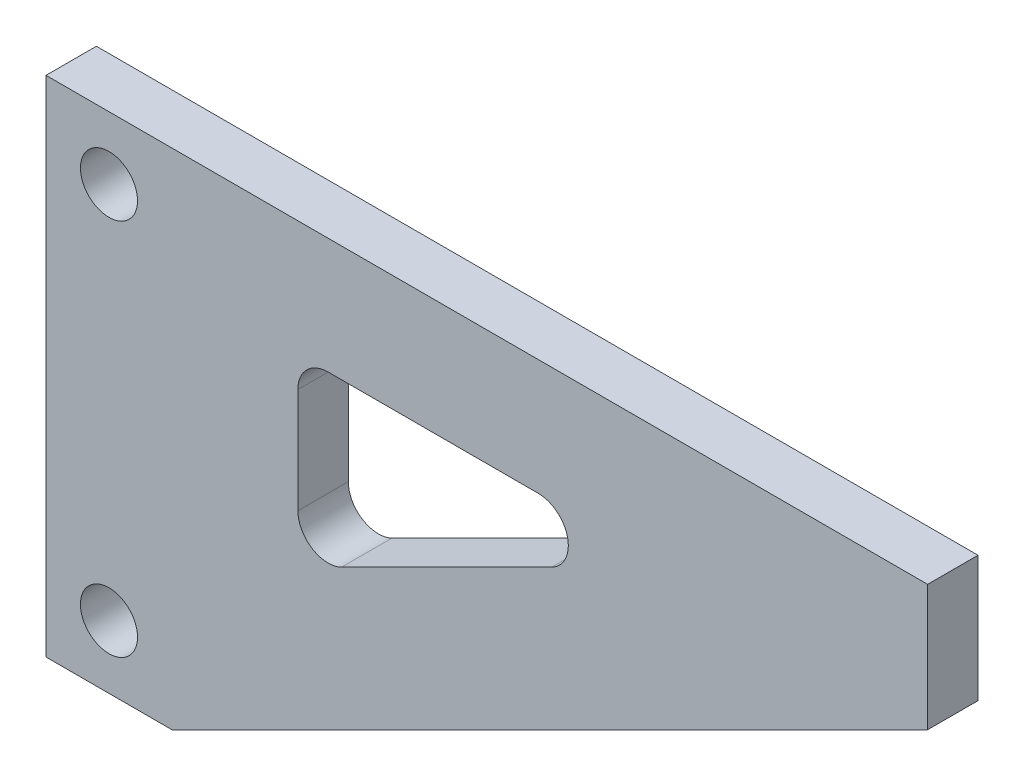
from build123d import *

# Parameters (mm, degrees)
BOSS_EXTRUDE1_DEPTH = 5
CUT_EXTRUDE1_DEPTH  = 202.804360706
SKETCH3_R           = 5.667551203
CUT_EXTRUDE2_DEPTH  = 202.804360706


with BuildPart() as part:
    # Sketch1 → Boss-Extrude1 (new, symmetric)
    with BuildSketch(Plane.XY):
        Polygon((0, 100), (175, 100), (175, 75), (25, 0), (0, 0), align=None)
    extrude(amount=BOSS_EXTRUDE1_DEPTH, both=True)

    # Sketch2 → Cut-Extrude1 (cut, through all)
    with BuildSketch(Plane.XY.offset(5)):
        with BuildLine():
            Line((50, 71), (50, 50.159053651))
            ThreePointArc((50, 50.159053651), (52.845613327, 45.055148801), (58.683281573, 44.792490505))
            Line((58.683281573, 44.792490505), (100.365174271, 65.633436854))
            ThreePointArc((100.365174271, 65.633436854), (103.521386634, 72.378517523), (97.681892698, 77))
            Line((97.681892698, 77), (56, 77))
            ThreePointArc((56, 77), (51.757359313, 75.242640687), (50, 71))
        make_face()
    extrude(amount=-CUT_EXTRUDE1_DEPTH, mode=Mode.SUBTRACT)

    # Sketch3 → Cut-Extrude2 (cut, through all)
    with BuildSketch(Plane.XY.offset(5)):
        with Locations((12.5, 87.5)):
            Circle(SKETCH3_R)
        with Locations((12.5, 12.5)):
            Circle(SKETCH3_R)
    extrude(amount=-CUT_EXTRUDE2_DEPTH, mode=Mode.SUBTRACT)


solid = part.part
